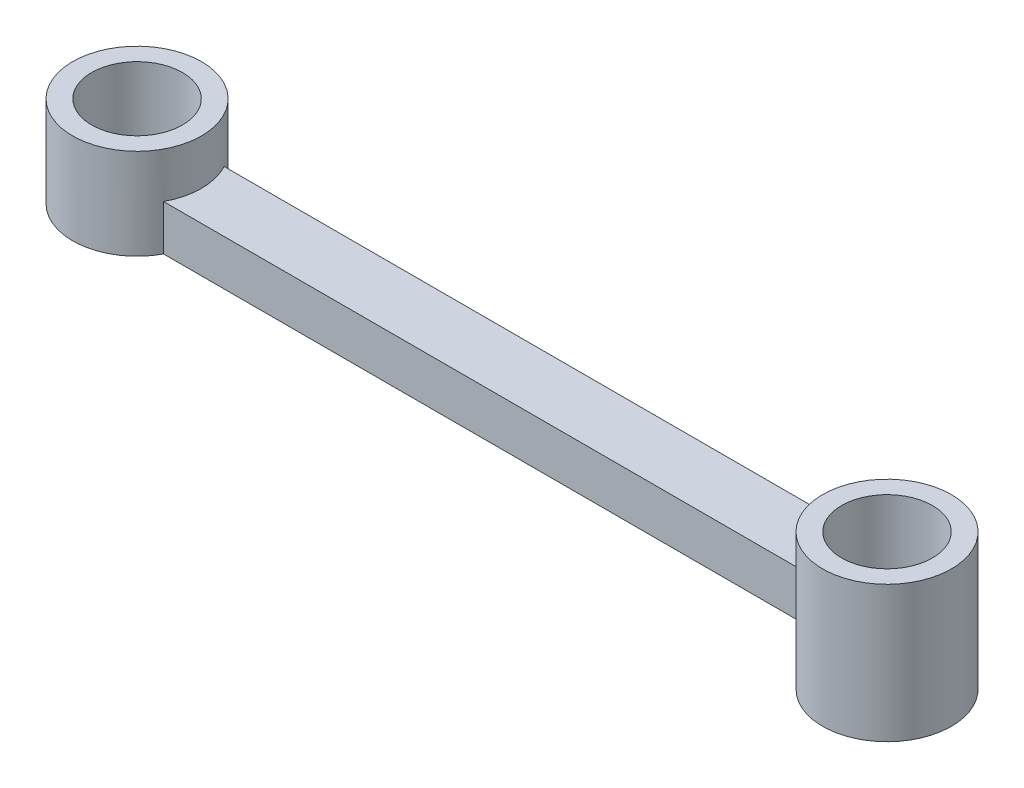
ISO-10303-21;
HEADER;
FILE_DESCRIPTION(('STEP AP214'),'2;1');
FILE_NAME('part.step','',(''),(''),'','','');
FILE_SCHEMA(('AUTOMOTIVE_DESIGN { 1 0 10303 214 1 1 1 1 }'));
ENDSEC;
DATA;
#1=APPLICATION_CONTEXT('core data for automotive mechanical design processes');
#2=APPLICATION_PROTOCOL_DEFINITION('international standard','automotive_design',2000,#1);
#3=PRODUCT_CONTEXT('',#1,'mechanical');
#4=PRODUCT('Part','Part','',(#3));
#5=PRODUCT_RELATED_PRODUCT_CATEGORY('part','',(#4));
#6=PRODUCT_DEFINITION_FORMATION('','',#4);
#7=PRODUCT_DEFINITION_CONTEXT('part definition',#1,'design');
#8=PRODUCT_DEFINITION('design','',#6,#7);
#9=PRODUCT_DEFINITION_SHAPE('','',#8);
#10=(LENGTH_UNIT() NAMED_UNIT(*) SI_UNIT(.MILLI.,.METRE.));
#11=(NAMED_UNIT(*) PLANE_ANGLE_UNIT() SI_UNIT($,.RADIAN.));
#12=(NAMED_UNIT(*) SI_UNIT($,.STERADIAN.) SOLID_ANGLE_UNIT());
#13=UNCERTAINTY_MEASURE_WITH_UNIT(LENGTH_MEASURE(1.E-05),#10,'distance_accuracy_value','');
#14=(GEOMETRIC_REPRESENTATION_CONTEXT(3) GLOBAL_UNCERTAINTY_ASSIGNED_CONTEXT((#13)) GLOBAL_UNIT_ASSIGNED_CONTEXT((#10,
#11,#12)) REPRESENTATION_CONTEXT('',''));
#15=CARTESIAN_POINT('',(0.,0.,0.));
#16=DIRECTION('',(0.,0.,1.));
#17=DIRECTION('',(1.,0.,0.));
#18=AXIS2_PLACEMENT_3D('',#15,#16,#17);
#19=CARTESIAN_POINT('',(49.5,6.00000000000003,0.));
#20=DIRECTION('',(0.,-1.,0.));
#21=DIRECTION('',(0.,0.,-1.));
#22=AXIS2_PLACEMENT_3D('',#19,#20,#21);
#23=CYLINDRICAL_SURFACE('',#22,3.);
#24=CARTESIAN_POINT('',(49.5,-2.99999999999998,0.));
#25=DIRECTION('',(0.,-1.,0.));
#26=DIRECTION('',(0.,0.,-1.));
#27=AXIS2_PLACEMENT_3D('',#24,#25,#26);
#28=CIRCLE('',#27,3.);
#29=CARTESIAN_POINT('',(49.5,-2.99999999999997,-2.99999999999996));
#30=VERTEX_POINT('',#29);
#31=EDGE_CURVE('E107',#30,#30,#28,.T.);
#32=ORIENTED_EDGE('',*,*,#31,.T.);
#33=EDGE_LOOP('',(#32));
#34=FACE_BOUND('',#33,.T.);
#35=CARTESIAN_POINT('',(49.5,6.00000000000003,0.));
#36=DIRECTION('',(0.,-1.,0.));
#37=DIRECTION('',(0.,0.,-1.));
#38=AXIS2_PLACEMENT_3D('',#35,#36,#37);
#39=CIRCLE('',#38,3.);
#40=CARTESIAN_POINT('',(49.5,6.00000000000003,-2.99999999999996));
#41=VERTEX_POINT('',#40);
#42=EDGE_CURVE('E20',#41,#41,#39,.T.);
#43=ORIENTED_EDGE('',*,*,#42,.F.);
#44=EDGE_LOOP('',(#43));
#45=FACE_BOUND('',#44,.T.);
#46=ADVANCED_FACE('F17',(#34,#45),#23,.F.);
#47=CARTESIAN_POINT('',(0.,6.00000000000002,0.));
#48=DIRECTION('',(0.,1.,0.));
#49=DIRECTION('',(0.,0.,1.));
#50=AXIS2_PLACEMENT_3D('',#47,#48,#49);
#51=PLANE('',#50);
#52=CARTESIAN_POINT('',(49.5,6.00000000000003,0.));
#53=DIRECTION('',(0.,-1.,0.));
#54=DIRECTION('',(0.,0.,-1.));
#55=AXIS2_PLACEMENT_3D('',#52,#53,#54);
#56=CIRCLE('',#55,4.25);
#57=CARTESIAN_POINT('',(49.5,6.00000000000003,-4.24999999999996));
#58=VERTEX_POINT('',#57);
#59=EDGE_CURVE('E70',#58,#58,#56,.T.);
#60=ORIENTED_EDGE('',*,*,#59,.F.);
#61=EDGE_LOOP('',(#60));
#62=FACE_BOUND('',#61,.T.);
#63=ORIENTED_EDGE('',*,*,#42,.T.);
#64=EDGE_LOOP('',(#63));
#65=FACE_BOUND('',#64,.T.);
#66=ADVANCED_FACE('F114',(#62,#65),#51,.T.);
#67=CARTESIAN_POINT('',(0.,-3.,0.));
#68=DIRECTION('',(0.,1.,0.));
#69=DIRECTION('',(0.,0.,1.));
#70=AXIS2_PLACEMENT_3D('',#67,#68,#69);
#71=PLANE('',#70);
#72=CARTESIAN_POINT('',(49.5,-2.99999999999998,0.));
#73=DIRECTION('',(0.,-1.,0.));
#74=DIRECTION('',(0.,0.,-1.));
#75=AXIS2_PLACEMENT_3D('',#72,#73,#74);
#76=CIRCLE('',#75,4.25);
#77=CARTESIAN_POINT('',(49.5,-2.99999999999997,-4.24999999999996));
#78=VERTEX_POINT('',#77);
#79=EDGE_CURVE('E84',#78,#78,#76,.F.);
#80=ORIENTED_EDGE('',*,*,#79,.F.);
#81=EDGE_LOOP('',(#80));
#82=FACE_BOUND('',#81,.T.);
#83=ORIENTED_EDGE('',*,*,#31,.F.);
#84=EDGE_LOOP('',(#83));
#85=FACE_BOUND('',#84,.T.);
#86=ADVANCED_FACE('F121',(#82,#85),#71,.F.);
#87=CARTESIAN_POINT('',(0.,6.00000000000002,0.));
#88=DIRECTION('',(0.,1.,0.));
#89=DIRECTION('',(0.,0.,1.));
#90=AXIS2_PLACEMENT_3D('',#87,#88,#89);
#91=PLANE('',#90);
#92=CARTESIAN_POINT('',(0.,6.00000000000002,0.));
#93=DIRECTION('',(0.,-1.,0.));
#94=DIRECTION('',(0.,0.,-1.));
#95=AXIS2_PLACEMENT_3D('',#92,#93,#94);
#96=CIRCLE('',#95,4.25);
#97=CARTESIAN_POINT('',(0.,6.00000000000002,-4.24999999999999));
#98=VERTEX_POINT('',#97);
#99=EDGE_CURVE('E93',#98,#98,#96,.T.);
#100=ORIENTED_EDGE('',*,*,#99,.F.);
#101=EDGE_LOOP('',(#100));
#102=FACE_BOUND('',#101,.T.);
#103=CARTESIAN_POINT('',(0.,6.00000000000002,0.));
#104=DIRECTION('',(0.,-1.,0.));
#105=DIRECTION('',(0.,0.,-1.));
#106=AXIS2_PLACEMENT_3D('',#103,#104,#105);
#107=CIRCLE('',#106,3.);
#108=CARTESIAN_POINT('',(0.,6.00000000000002,-2.99999999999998));
#109=VERTEX_POINT('',#108);
#110=EDGE_CURVE('E71',#109,#109,#107,.T.);
#111=ORIENTED_EDGE('',*,*,#110,.T.);
#112=EDGE_LOOP('',(#111));
#113=FACE_BOUND('',#112,.T.);
#114=ADVANCED_FACE('F148',(#102,#113),#91,.T.);
#115=CARTESIAN_POINT('',(0.,3.00000000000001,0.));
#116=DIRECTION('',(0.,1.,0.));
#117=DIRECTION('',(0.,0.,1.));
#118=AXIS2_PLACEMENT_3D('',#115,#116,#117);
#119=PLANE('',#118);
#120=CARTESIAN_POINT('',(0.,3.00000000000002,0.));
#121=DIRECTION('',(0.,-1.,0.));
#122=DIRECTION('',(0.,0.,-1.));
#123=AXIS2_PLACEMENT_3D('',#120,#121,#122);
#124=CIRCLE('',#123,4.25);
#125=CARTESIAN_POINT('',(3.75000000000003,3.00000000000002,2.));
#126=VERTEX_POINT('',#125);
#127=CARTESIAN_POINT('',(3.75000000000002,3.00000000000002,-1.99999999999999));
#128=VERTEX_POINT('',#127);
#129=EDGE_CURVE('E65',#126,#128,#124,.F.);
#130=ORIENTED_EDGE('',*,*,#129,.F.);
#131=DIRECTION('',(1.,0.,0.));
#132=VECTOR('',#131,1.);
#133=CARTESIAN_POINT('',(0.,3.00000000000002,2.00000000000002));
#134=LINE('',#133,#132);
#135=CARTESIAN_POINT('',(45.75,3.00000000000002,2.00000000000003));
#136=VERTEX_POINT('',#135);
#137=EDGE_CURVE('E60',#126,#136,#134,.T.);
#138=ORIENTED_EDGE('',*,*,#137,.T.);
#139=CARTESIAN_POINT('',(49.5,3.00000000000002,0.));
#140=DIRECTION('',(0.,-1.,0.));
#141=DIRECTION('',(0.,0.,-1.));
#142=AXIS2_PLACEMENT_3D('',#139,#140,#141);
#143=CIRCLE('',#142,4.25);
#144=CARTESIAN_POINT('',(45.75,3.00000000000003,-1.99999999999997));
#145=VERTEX_POINT('',#144);
#146=EDGE_CURVE('E63',#145,#136,#143,.F.);
#147=ORIENTED_EDGE('',*,*,#146,.F.);
#148=DIRECTION('',(1.,0.,0.));
#149=VECTOR('',#148,1.);
#150=CARTESIAN_POINT('',(0.,3.00000000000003,-1.99999999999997));
#151=LINE('',#150,#149);
#152=EDGE_CURVE('E55',#128,#145,#151,.T.);
#153=ORIENTED_EDGE('',*,*,#152,.F.);
#154=EDGE_LOOP('',(#130,#138,#147,#153));
#155=FACE_BOUND('',#154,.T.);
#156=ADVANCED_FACE('F62',(#155),#119,.T.);
#157=CARTESIAN_POINT('',(0.,6.00000000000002,0.));
#158=DIRECTION('',(0.,-1.,0.));
#159=DIRECTION('',(0.,0.,-1.));
#160=AXIS2_PLACEMENT_3D('',#157,#158,#159);
#161=CYLINDRICAL_SURFACE('',#160,3.);
#162=CARTESIAN_POINT('',(0.,0.,0.));
#163=DIRECTION('',(0.,-1.,0.));
#164=DIRECTION('',(0.,0.,-1.));
#165=AXIS2_PLACEMENT_3D('',#162,#163,#164);
#166=CIRCLE('',#165,3.);
#167=CARTESIAN_POINT('',(0.,0.,-2.99999999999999));
#168=VERTEX_POINT('',#167);
#169=EDGE_CURVE('E97',#168,#168,#166,.T.);
#170=ORIENTED_EDGE('',*,*,#169,.T.);
#171=EDGE_LOOP('',(#170));
#172=FACE_BOUND('',#171,.T.);
#173=ORIENTED_EDGE('',*,*,#110,.F.);
#174=EDGE_LOOP('',(#173));
#175=FACE_BOUND('',#174,.T.);
#176=ADVANCED_FACE('F142',(#172,#175),#161,.F.);
#177=CARTESIAN_POINT('',(0.,3.,2.00000000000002));
#178=DIRECTION('',(0.,0.,-1.));
#179=DIRECTION('',(0.,1.,0.));
#180=AXIS2_PLACEMENT_3D('',#177,#178,#179);
#181=PLANE('',#180);
#182=DIRECTION('',(0.,-1.,0.));
#183=VECTOR('',#182,1.);
#184=CARTESIAN_POINT('',(45.75,6.00000000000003,2.00000000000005));
#185=LINE('',#184,#183);
#186=CARTESIAN_POINT('',(45.75,0.,2.00000000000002));
#187=VERTEX_POINT('',#186);
#188=EDGE_CURVE('E77',#136,#187,#185,.T.);
#189=ORIENTED_EDGE('',*,*,#188,.F.);
#190=ORIENTED_EDGE('',*,*,#137,.F.);
#191=DIRECTION('',(0.,-1.,0.));
#192=VECTOR('',#191,1.);
#193=CARTESIAN_POINT('',(3.75000000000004,6.00000000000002,1.99999999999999));
#194=LINE('',#193,#192);
#195=CARTESIAN_POINT('',(3.75000000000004,0.,2.));
#196=VERTEX_POINT('',#195);
#197=EDGE_CURVE('E91',#196,#126,#194,.F.);
#198=ORIENTED_EDGE('',*,*,#197,.F.);
#199=DIRECTION('',(1.,0.,0.));
#200=VECTOR('',#199,1.);
#201=CARTESIAN_POINT('',(0.,0.,2.));
#202=LINE('',#201,#200);
#203=EDGE_CURVE('E83',#196,#187,#202,.T.);
#204=ORIENTED_EDGE('',*,*,#203,.T.);
#205=EDGE_LOOP('',(#189,#190,#198,#204));
#206=FACE_BOUND('',#205,.T.);
#207=ADVANCED_FACE('F82',(#206),#181,.F.);
#208=CARTESIAN_POINT('',(49.5,6.00000000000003,0.));
#209=DIRECTION('',(0.,-1.,0.));
#210=DIRECTION('',(0.,0.,-1.));
#211=AXIS2_PLACEMENT_3D('',#208,#209,#210);
#212=CYLINDRICAL_SURFACE('',#211,4.25);
#213=ORIENTED_EDGE('',*,*,#59,.T.);
#214=EDGE_LOOP('',(#213));
#215=FACE_BOUND('',#214,.T.);
#216=DIRECTION('',(0.,1.,0.));
#217=VECTOR('',#216,1.);
#218=CARTESIAN_POINT('',(45.75,3.00000000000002,-1.99999999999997));
#219=LINE('',#218,#217);
#220=CARTESIAN_POINT('',(45.75,0.,-1.99999999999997));
#221=VERTEX_POINT('',#220);
#222=EDGE_CURVE('E79',#145,#221,#219,.F.);
#223=ORIENTED_EDGE('',*,*,#222,.F.);
#224=ORIENTED_EDGE('',*,*,#146,.T.);
#225=ORIENTED_EDGE('',*,*,#188,.T.);
#226=CARTESIAN_POINT('',(49.5,0.,0.));
#227=DIRECTION('',(0.,-1.,0.));
#228=DIRECTION('',(0.,0.,-1.));
#229=AXIS2_PLACEMENT_3D('',#226,#227,#228);
#230=CIRCLE('',#229,4.25);
#231=EDGE_CURVE('E26',#187,#221,#230,.T.);
#232=ORIENTED_EDGE('',*,*,#231,.T.);
#233=EDGE_LOOP('',(#223,#224,#225,#232));
#234=FACE_BOUND('',#233,.T.);
#235=ORIENTED_EDGE('',*,*,#79,.T.);
#236=EDGE_LOOP('',(#235));
#237=FACE_BOUND('',#236,.T.);
#238=ADVANCED_FACE('F74',(#215,#234,#237),#212,.T.);
#239=CARTESIAN_POINT('',(0.,3.00000000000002,-1.99999999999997));
#240=DIRECTION('',(0.,0.,-1.));
#241=DIRECTION('',(0.,1.,0.));
#242=AXIS2_PLACEMENT_3D('',#239,#240,#241);
#243=PLANE('',#242);
#244=ORIENTED_EDGE('',*,*,#152,.T.);
#245=ORIENTED_EDGE('',*,*,#222,.T.);
#246=DIRECTION('',(1.,0.,0.));
#247=VECTOR('',#246,1.);
#248=CARTESIAN_POINT('',(0.,0.,-1.99999999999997));
#249=LINE('',#248,#247);
#250=CARTESIAN_POINT('',(3.75000000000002,0.,-1.99999999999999));
#251=VERTEX_POINT('',#250);
#252=EDGE_CURVE('E11',#221,#251,#249,.F.);
#253=ORIENTED_EDGE('',*,*,#252,.T.);
#254=DIRECTION('',(0.,-1.,0.));
#255=VECTOR('',#254,1.);
#256=CARTESIAN_POINT('',(3.75000000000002,6.00000000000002,-2.00000000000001));
#257=LINE('',#256,#255);
#258=EDGE_CURVE('E100',#128,#251,#257,.T.);
#259=ORIENTED_EDGE('',*,*,#258,.F.);
#260=EDGE_LOOP('',(#244,#245,#253,#259));
#261=FACE_BOUND('',#260,.T.);
#262=ADVANCED_FACE('F130',(#261),#243,.T.);
#263=CARTESIAN_POINT('',(0.,6.00000000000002,0.));
#264=DIRECTION('',(0.,-1.,0.));
#265=DIRECTION('',(0.,0.,-1.));
#266=AXIS2_PLACEMENT_3D('',#263,#264,#265);
#267=CYLINDRICAL_SURFACE('',#266,4.25);
#268=CARTESIAN_POINT('',(0.,0.,0.));
#269=DIRECTION('',(0.,-1.,0.));
#270=DIRECTION('',(0.,0.,-1.));
#271=AXIS2_PLACEMENT_3D('',#268,#269,#270);
#272=CIRCLE('',#271,4.25);
#273=EDGE_CURVE('E35',#251,#196,#272,.F.);
#274=ORIENTED_EDGE('',*,*,#273,.T.);
#275=ORIENTED_EDGE('',*,*,#197,.T.);
#276=ORIENTED_EDGE('',*,*,#129,.T.);
#277=ORIENTED_EDGE('',*,*,#258,.T.);
#278=EDGE_LOOP('',(#274,#275,#276,#277));
#279=FACE_BOUND('',#278,.T.);
#280=ORIENTED_EDGE('',*,*,#99,.T.);
#281=EDGE_LOOP('',(#280));
#282=FACE_BOUND('',#281,.T.);
#283=ADVANCED_FACE('F125',(#279,#282),#267,.T.);
#284=CARTESIAN_POINT('',(0.,0.,0.));
#285=DIRECTION('',(0.,1.,0.));
#286=DIRECTION('',(0.,0.,1.));
#287=AXIS2_PLACEMENT_3D('',#284,#285,#286);
#288=PLANE('',#287);
#289=ORIENTED_EDGE('',*,*,#252,.F.);
#290=ORIENTED_EDGE('',*,*,#231,.F.);
#291=ORIENTED_EDGE('',*,*,#203,.F.);
#292=ORIENTED_EDGE('',*,*,#273,.F.);
#293=EDGE_LOOP('',(#289,#290,#291,#292));
#294=FACE_BOUND('',#293,.T.);
#295=ORIENTED_EDGE('',*,*,#169,.F.);
#296=EDGE_LOOP('',(#295));
#297=FACE_BOUND('',#296,.T.);
#298=ADVANCED_FACE('F123',(#294,#297),#288,.F.);
#299=CLOSED_SHELL('',(#46,#66,#86,#114,#156,#176,#207,#238,#262,#283,#298));
#300=MANIFOLD_SOLID_BREP('B1',#299);
#301=ADVANCED_BREP_SHAPE_REPRESENTATION('',(#18,#300),#14);
#302=SHAPE_DEFINITION_REPRESENTATION(#9,#301);
ENDSEC;
END-ISO-10303-21;
